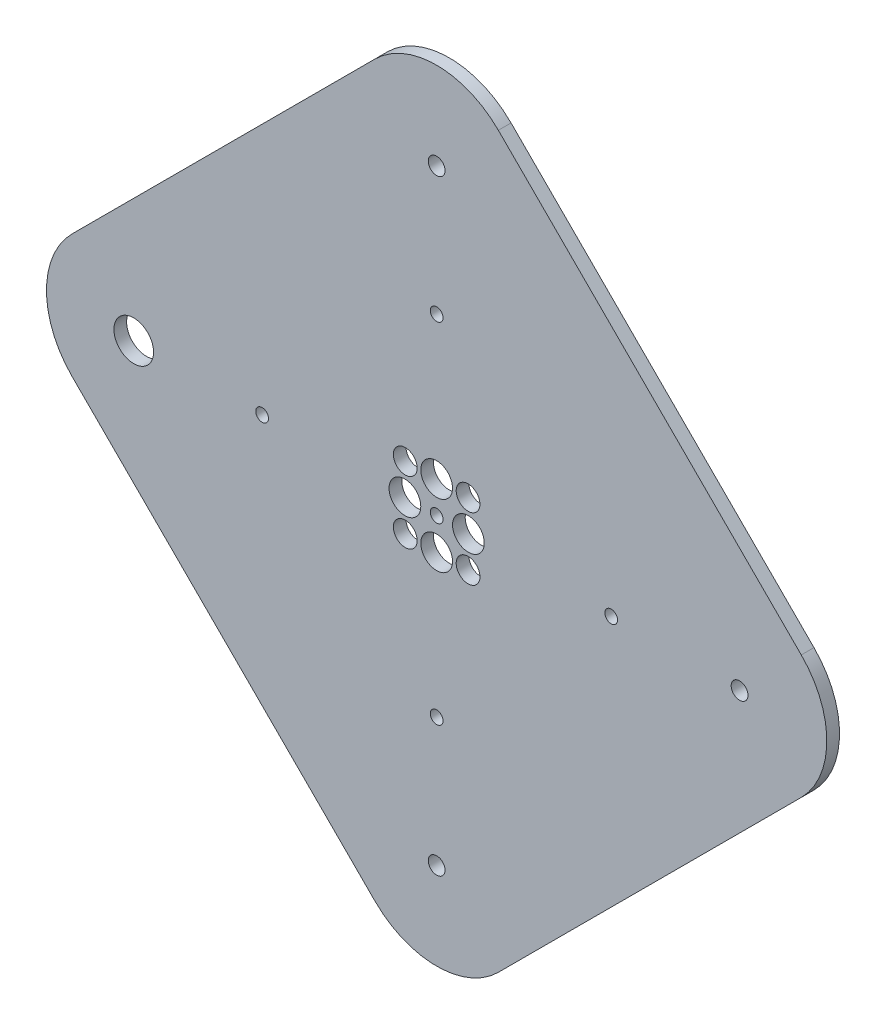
from build123d import *

# Parameters (mm, degrees)
BOSS_EXTRUDE2_DEPTH         = 5.08
SKETCH22_R                  = 6.35
CUT_EXTRUDE4_DEPTH          = 221.899828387
F_1_4_20_TAPPED_HOLE1_D     = 5.1054
F_1_4_20_TAPPED_HOLE1_DEPTH = 9.525
F_1_4_20_TAPPED_HOLE1_TIP   = 1.533816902
SKETCH25_R                  = 4.7625
CUT_EXTRUDE5_DEPTH          = 221.899828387
SKETCH26_R                  = 7.9375
SKETCH26_R_2                = 3.3655
CUT_EXTRUDE6_DEPTH          = 221.899828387
F_1_4_20_TAPPED_HOLE2_D     = 5.1054


with BuildPart() as part:
    # Sketch19 → Boss-Extrude2 (new body)
    with BuildSketch(Plane.XY):
        with BuildLine():
            Line((-145.929161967, -24.695704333), (-24.695704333, -145.929161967))
            ThreePointArc((-24.695704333, -145.929161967), (0, -156.158457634), (24.695704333, -145.929161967))
            Line((24.695704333, -145.929161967), (145.929161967, -24.695704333))
            ThreePointArc((145.929161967, -24.695704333), (156.158457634, 0), (145.929161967, 24.695704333))
            Line((145.929161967, 24.695704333), (24.695704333, 145.929161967))
            ThreePointArc((24.695704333, 145.929161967), (0, 156.158457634), (-24.695704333, 145.929161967))
            Line((-24.695704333, 145.929161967), (-145.929161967, 24.695704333))
            ThreePointArc((-145.929161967, 24.695704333), (-156.158457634, 0), (-145.929161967, -24.695704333))
        make_face()
    extrude(amount=BOSS_EXTRUDE2_DEPTH)

    # Sketch22 → Cut-Extrude4 (cut, through all)
    with BuildSketch(Plane.XY.offset(5.08)):
        with Locations((0, 12.7)):
            Circle(SKETCH22_R)
        with Locations((12.7, 0)):
            Circle(SKETCH22_R)
        with Locations((0, -12.7)):
            Circle(SKETCH22_R)
        with Locations((-12.7, 0)):
            Circle(SKETCH22_R)
    extrude(amount=-CUT_EXTRUDE4_DEPTH, mode=Mode.SUBTRACT)

    # 1_4-20 Tapped Hole1
    with Locations(Plane.XY.offset(5.08)):
        with Locations((0, 0)):
            Hole(F_1_4_20_TAPPED_HOLE1_D / 2, depth=F_1_4_20_TAPPED_HOLE1_DEPTH)
            with Locations((0, 0, -(F_1_4_20_TAPPED_HOLE1_DEPTH + F_1_4_20_TAPPED_HOLE1_TIP / 2))):  # 118° drill point
                Cone(0, F_1_4_20_TAPPED_HOLE1_D / 2, F_1_4_20_TAPPED_HOLE1_TIP, mode=Mode.SUBTRACT)

    # Sketch25 → Cut-Extrude5 (cut, through all)
    with BuildSketch(Plane.XY.offset(5.08)):
        with Locations((-12.572358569, 12.572358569)):
            Circle(SKETCH25_R)
        with Locations((12.572358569, 12.572358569)):
            Circle(SKETCH25_R)
        with Locations((12.572358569, -12.572358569)):
            Circle(SKETCH25_R)
        with Locations((-12.572358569, -12.572358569)):
            Circle(SKETCH25_R)
    extrude(amount=-CUT_EXTRUDE5_DEPTH, mode=Mode.SUBTRACT)

    # Sketch26 → Cut-Extrude6 (cut, through all)
    with BuildSketch(Plane.XY.offset(5.08)):
        with Locations((-121.233457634, 0)):
            Circle(SKETCH26_R)
        with Locations((0, 121.233457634)):
            Circle(SKETCH26_R_2)
        with Locations((121.233457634, 0)):
            Circle(SKETCH26_R_2)
        with Locations((0, -121.233457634)):
            Circle(SKETCH26_R_2)
    extrude(amount=-CUT_EXTRUDE6_DEPTH, mode=Mode.SUBTRACT)

    # 1_4-20 Tapped Hole2 (through all)
    with Locations(Plane.XY.offset(5.08)):
        with Locations((0, 69.85), (69.85, 0), (0, -69.85), (-69.85, 0)):
            Hole(F_1_4_20_TAPPED_HOLE2_D / 2)


solid = part.part
